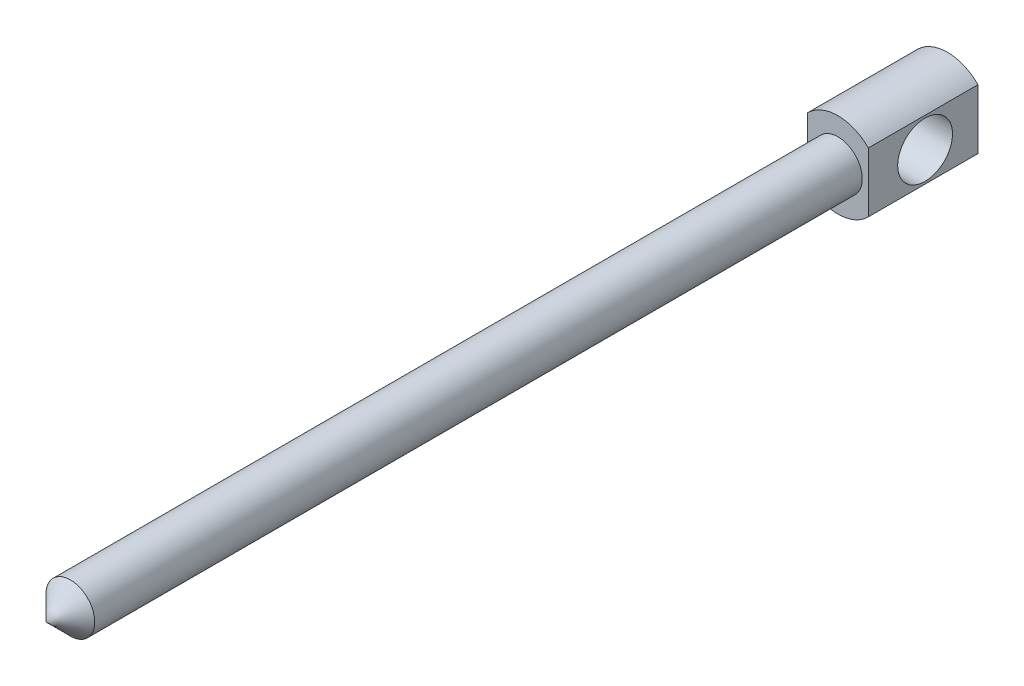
ISO-10303-21;
HEADER;
FILE_DESCRIPTION(('STEP AP214'),'2;1');
FILE_NAME('part.step','',(''),(''),'','','');
FILE_SCHEMA(('AUTOMOTIVE_DESIGN { 1 0 10303 214 1 1 1 1 }'));
ENDSEC;
DATA;
#1=APPLICATION_CONTEXT('core data for automotive mechanical design processes');
#2=APPLICATION_PROTOCOL_DEFINITION('international standard','automotive_design',2000,#1);
#3=PRODUCT_CONTEXT('',#1,'mechanical');
#4=PRODUCT('Part','Part','',(#3));
#5=PRODUCT_RELATED_PRODUCT_CATEGORY('part','',(#4));
#6=PRODUCT_DEFINITION_FORMATION('','',#4);
#7=PRODUCT_DEFINITION_CONTEXT('part definition',#1,'design');
#8=PRODUCT_DEFINITION('design','',#6,#7);
#9=PRODUCT_DEFINITION_SHAPE('','',#8);
#10=(LENGTH_UNIT() NAMED_UNIT(*) SI_UNIT(.MILLI.,.METRE.));
#11=(NAMED_UNIT(*) PLANE_ANGLE_UNIT() SI_UNIT($,.RADIAN.));
#12=(NAMED_UNIT(*) SI_UNIT($,.STERADIAN.) SOLID_ANGLE_UNIT());
#13=UNCERTAINTY_MEASURE_WITH_UNIT(LENGTH_MEASURE(1.E-05),#10,'distance_accuracy_value','');
#14=(GEOMETRIC_REPRESENTATION_CONTEXT(3) GLOBAL_UNCERTAINTY_ASSIGNED_CONTEXT((#13)) GLOBAL_UNIT_ASSIGNED_CONTEXT((#10,
#11,#12)) REPRESENTATION_CONTEXT('',''));
#15=CARTESIAN_POINT('',(0.,0.,0.));
#16=DIRECTION('',(0.,0.,1.));
#17=DIRECTION('',(1.,0.,0.));
#18=AXIS2_PLACEMENT_3D('',#15,#16,#17);
#19=CARTESIAN_POINT('',(0.,0.,-9.));
#20=DIRECTION('',(0.,0.,1.));
#21=DIRECTION('',(1.,0.,0.));
#22=AXIS2_PLACEMENT_3D('',#19,#20,#21);
#23=CYLINDRICAL_SURFACE('',#22,3.5);
#24=CARTESIAN_POINT('',(0.,0.,-9.));
#25=DIRECTION('',(0.,0.,-1.));
#26=DIRECTION('',(-1.,0.,0.));
#27=AXIS2_PLACEMENT_3D('',#24,#25,#26);
#28=CIRCLE('',#27,3.5);
#29=CARTESIAN_POINT('',(2.5,-2.44948974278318,-9.));
#30=VERTEX_POINT('',#29);
#31=CARTESIAN_POINT('',(-2.5,-2.44948974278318,-9.));
#32=VERTEX_POINT('',#31);
#33=EDGE_CURVE('E90',#30,#32,#28,.T.);
#34=ORIENTED_EDGE('',*,*,#33,.F.);
#35=DIRECTION('',(0.,0.,1.));
#36=VECTOR('',#35,1.);
#37=CARTESIAN_POINT('',(2.5,-2.44948974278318,-9.));
#38=LINE('',#37,#36);
#39=CARTESIAN_POINT('',(2.5,-2.44948974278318,0.));
#40=VERTEX_POINT('',#39);
#41=EDGE_CURVE('E45',#30,#40,#38,.T.);
#42=ORIENTED_EDGE('',*,*,#41,.T.);
#43=CARTESIAN_POINT('',(0.,0.,0.));
#44=DIRECTION('',(0.,0.,-1.));
#45=DIRECTION('',(-1.,0.,0.));
#46=AXIS2_PLACEMENT_3D('',#43,#44,#45);
#47=CIRCLE('',#46,3.5);
#48=CARTESIAN_POINT('',(-2.5,-2.44948974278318,0.));
#49=VERTEX_POINT('',#48);
#50=EDGE_CURVE('E99',#40,#49,#47,.T.);
#51=ORIENTED_EDGE('',*,*,#50,.T.);
#52=DIRECTION('',(0.,0.,1.));
#53=VECTOR('',#52,1.);
#54=CARTESIAN_POINT('',(-2.5,-2.44948974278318,-9.));
#55=LINE('',#54,#53);
#56=EDGE_CURVE('E105',#49,#32,#55,.F.);
#57=ORIENTED_EDGE('',*,*,#56,.T.);
#58=EDGE_LOOP('',(#34,#42,#51,#57));
#59=FACE_BOUND('',#58,.T.);
#60=ADVANCED_FACE('F31',(#59),#23,.T.);
#61=CARTESIAN_POINT('',(0.,0.,65.));
#62=DIRECTION('',(0.,0.,-1.));
#63=DIRECTION('',(-1.,0.,0.));
#64=AXIS2_PLACEMENT_3D('',#61,#62,#63);
#65=CYLINDRICAL_SURFACE('',#64,2.);
#66=CARTESIAN_POINT('',(0.,0.,63.));
#67=DIRECTION('',(0.,0.,1.));
#68=DIRECTION('',(1.,0.,0.));
#69=AXIS2_PLACEMENT_3D('',#66,#67,#68);
#70=CIRCLE('',#69,2.);
#71=CARTESIAN_POINT('',(2.,0.,63.));
#72=VERTEX_POINT('',#71);
#73=EDGE_CURVE('E93',#72,#72,#70,.F.);
#74=ORIENTED_EDGE('',*,*,#73,.T.);
#75=EDGE_LOOP('',(#74));
#76=FACE_BOUND('',#75,.T.);
#77=CARTESIAN_POINT('',(0.,0.,0.));
#78=DIRECTION('',(0.,0.,-1.));
#79=DIRECTION('',(-1.,0.,0.));
#80=AXIS2_PLACEMENT_3D('',#77,#78,#79);
#81=CIRCLE('',#80,2.);
#82=CARTESIAN_POINT('',(-2.,0.,0.));
#83=VERTEX_POINT('',#82);
#84=EDGE_CURVE('E89',#83,#83,#81,.T.);
#85=ORIENTED_EDGE('',*,*,#84,.F.);
#86=EDGE_LOOP('',(#85));
#87=FACE_BOUND('',#86,.T.);
#88=ADVANCED_FACE('F136',(#76,#87),#65,.T.);
#89=CARTESIAN_POINT('',(0.,0.,63.));
#90=DIRECTION('',(0.,0.,-1.));
#91=DIRECTION('',(-1.,0.,0.));
#92=AXIS2_PLACEMENT_3D('',#89,#90,#91);
#93=CONICAL_SURFACE('',#92,2.00000000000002,0.78539816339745);
#94=ORIENTED_EDGE('',*,*,#73,.F.);
#95=EDGE_LOOP('',(#94));
#96=FACE_BOUND('',#95,.T.);
#97=CARTESIAN_POINT('',(0.,0.,65.));
#98=VERTEX_POINT('',#97);
#99=VERTEX_LOOP('',#98);
#100=FACE_BOUND('',#99,.T.);
#101=ADVANCED_FACE('F33',(#96,#100),#93,.T.);
#102=CARTESIAN_POINT('',(0.,0.,0.));
#103=DIRECTION('',(0.,0.,-1.));
#104=DIRECTION('',(-1.,0.,0.));
#105=AXIS2_PLACEMENT_3D('',#102,#103,#104);
#106=PLANE('',#105);
#107=ORIENTED_EDGE('',*,*,#50,.F.);
#108=DIRECTION('',(0.,1.,0.));
#109=VECTOR('',#108,1.);
#110=CARTESIAN_POINT('',(2.5,0.,0.));
#111=LINE('',#110,#109);
#112=CARTESIAN_POINT('',(2.5,2.44948974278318,0.));
#113=VERTEX_POINT('',#112);
#114=EDGE_CURVE('E109',#40,#113,#111,.T.);
#115=ORIENTED_EDGE('',*,*,#114,.T.);
#116=CARTESIAN_POINT('',(-2.5,2.44948974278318,0.));
#117=VERTEX_POINT('',#116);
#118=EDGE_CURVE('E85',#117,#113,#47,.T.);
#119=ORIENTED_EDGE('',*,*,#118,.F.);
#120=DIRECTION('',(0.,-1.,0.));
#121=VECTOR('',#120,1.);
#122=CARTESIAN_POINT('',(-2.5,0.,0.));
#123=LINE('',#122,#121);
#124=EDGE_CURVE('E97',#117,#49,#123,.T.);
#125=ORIENTED_EDGE('',*,*,#124,.T.);
#126=EDGE_LOOP('',(#107,#115,#119,#125));
#127=FACE_BOUND('',#126,.T.);
#128=ORIENTED_EDGE('',*,*,#84,.T.);
#129=EDGE_LOOP('',(#128));
#130=FACE_BOUND('',#129,.T.);
#131=ADVANCED_FACE('F144',(#127,#130),#106,.F.);
#132=ORIENTED_EDGE('',*,*,#118,.T.);
#133=DIRECTION('',(0.,0.,1.));
#134=VECTOR('',#133,1.);
#135=CARTESIAN_POINT('',(2.5,2.44948974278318,-9.));
#136=LINE('',#135,#134);
#137=CARTESIAN_POINT('',(2.5,2.44948974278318,-9.));
#138=VERTEX_POINT('',#137);
#139=EDGE_CURVE('E74',#113,#138,#136,.F.);
#140=ORIENTED_EDGE('',*,*,#139,.T.);
#141=CARTESIAN_POINT('',(-2.5,2.44948974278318,-9.));
#142=VERTEX_POINT('',#141);
#143=EDGE_CURVE('E83',#142,#138,#28,.T.);
#144=ORIENTED_EDGE('',*,*,#143,.F.);
#145=DIRECTION('',(0.,0.,1.));
#146=VECTOR('',#145,1.);
#147=CARTESIAN_POINT('',(-2.5,2.44948974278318,-9.));
#148=LINE('',#147,#146);
#149=EDGE_CURVE('E53',#142,#117,#148,.T.);
#150=ORIENTED_EDGE('',*,*,#149,.T.);
#151=EDGE_LOOP('',(#132,#140,#144,#150));
#152=FACE_BOUND('',#151,.T.);
#153=ADVANCED_FACE('F82',(#152),#23,.T.);
#154=CARTESIAN_POINT('',(0.,0.,-9.));
#155=DIRECTION('',(0.,0.,-1.));
#156=DIRECTION('',(-1.,0.,0.));
#157=AXIS2_PLACEMENT_3D('',#154,#155,#156);
#158=PLANE('',#157);
#159=DIRECTION('',(0.,1.,0.));
#160=VECTOR('',#159,1.);
#161=CARTESIAN_POINT('',(2.5,0.,-9.));
#162=LINE('',#161,#160);
#163=EDGE_CURVE('E11',#30,#138,#162,.T.);
#164=ORIENTED_EDGE('',*,*,#163,.F.);
#165=ORIENTED_EDGE('',*,*,#33,.T.);
#166=DIRECTION('',(0.,-1.,0.));
#167=VECTOR('',#166,1.);
#168=CARTESIAN_POINT('',(-2.5,0.,-9.));
#169=LINE('',#168,#167);
#170=EDGE_CURVE('E39',#142,#32,#169,.T.);
#171=ORIENTED_EDGE('',*,*,#170,.F.);
#172=ORIENTED_EDGE('',*,*,#143,.T.);
#173=EDGE_LOOP('',(#164,#165,#171,#172));
#174=FACE_BOUND('',#173,.T.);
#175=ADVANCED_FACE('F88',(#174),#158,.T.);
#176=CARTESIAN_POINT('',(-2.5,-3.5,-9.7210205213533));
#177=DIRECTION('',(1.,0.,0.));
#178=DIRECTION('',(0.,0.,-1.));
#179=AXIS2_PLACEMENT_3D('',#176,#177,#178);
#180=PLANE('',#179);
#181=CARTESIAN_POINT('',(-2.5,0.,-4.65736833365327));
#182=DIRECTION('',(-1.,0.,0.));
#183=DIRECTION('',(0.,0.,1.));
#184=AXIS2_PLACEMENT_3D('',#181,#182,#183);
#185=CIRCLE('',#184,2.25);
#186=CARTESIAN_POINT('',(-2.5,0.,-2.40736833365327));
#187=VERTEX_POINT('',#186);
#188=EDGE_CURVE('E114',#187,#187,#185,.T.);
#189=ORIENTED_EDGE('',*,*,#188,.F.);
#190=EDGE_LOOP('',(#189));
#191=FACE_BOUND('',#190,.T.);
#192=ORIENTED_EDGE('',*,*,#149,.F.);
#193=ORIENTED_EDGE('',*,*,#170,.T.);
#194=ORIENTED_EDGE('',*,*,#56,.F.);
#195=ORIENTED_EDGE('',*,*,#124,.F.);
#196=EDGE_LOOP('',(#192,#193,#194,#195));
#197=FACE_BOUND('',#196,.T.);
#198=ADVANCED_FACE('F104',(#191,#197),#180,.F.);
#199=CARTESIAN_POINT('',(2.5,-3.5,-10.6084303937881));
#200=DIRECTION('',(-1.,0.,0.));
#201=DIRECTION('',(0.,0.,1.));
#202=AXIS2_PLACEMENT_3D('',#199,#200,#201);
#203=PLANE('',#202);
#204=CARTESIAN_POINT('',(2.5,0.,-4.65736833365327));
#205=DIRECTION('',(-1.,0.,0.));
#206=DIRECTION('',(0.,0.,1.));
#207=AXIS2_PLACEMENT_3D('',#204,#205,#206);
#208=CIRCLE('',#207,2.25);
#209=CARTESIAN_POINT('',(2.5,0.,-2.40736833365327));
#210=VERTEX_POINT('',#209);
#211=EDGE_CURVE('E86',#210,#210,#208,.T.);
#212=ORIENTED_EDGE('',*,*,#211,.T.);
#213=EDGE_LOOP('',(#212));
#214=FACE_BOUND('',#213,.T.);
#215=ORIENTED_EDGE('',*,*,#41,.F.);
#216=ORIENTED_EDGE('',*,*,#163,.T.);
#217=ORIENTED_EDGE('',*,*,#139,.F.);
#218=ORIENTED_EDGE('',*,*,#114,.F.);
#219=EDGE_LOOP('',(#215,#216,#217,#218));
#220=FACE_BOUND('',#219,.T.);
#221=ADVANCED_FACE('F73',(#214,#220),#203,.F.);
#222=CARTESIAN_POINT('',(2.5,0.,-4.65736833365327));
#223=DIRECTION('',(-1.,0.,0.));
#224=DIRECTION('',(0.,0.,1.));
#225=AXIS2_PLACEMENT_3D('',#222,#223,#224);
#226=CYLINDRICAL_SURFACE('',#225,2.25);
#227=ORIENTED_EDGE('',*,*,#211,.F.);
#228=EDGE_LOOP('',(#227));
#229=FACE_BOUND('',#228,.T.);
#230=ORIENTED_EDGE('',*,*,#188,.T.);
#231=EDGE_LOOP('',(#230));
#232=FACE_BOUND('',#231,.T.);
#233=ADVANCED_FACE('F121',(#229,#232),#226,.F.);
#234=CLOSED_SHELL('',(#60,#88,#101,#131,#153,#175,#198,#221,#233));
#235=MANIFOLD_SOLID_BREP('B2',#234);
#236=ADVANCED_BREP_SHAPE_REPRESENTATION('',(#18,#235),#14);
#237=SHAPE_DEFINITION_REPRESENTATION(#9,#236);
ENDSEC;
END-ISO-10303-21;
